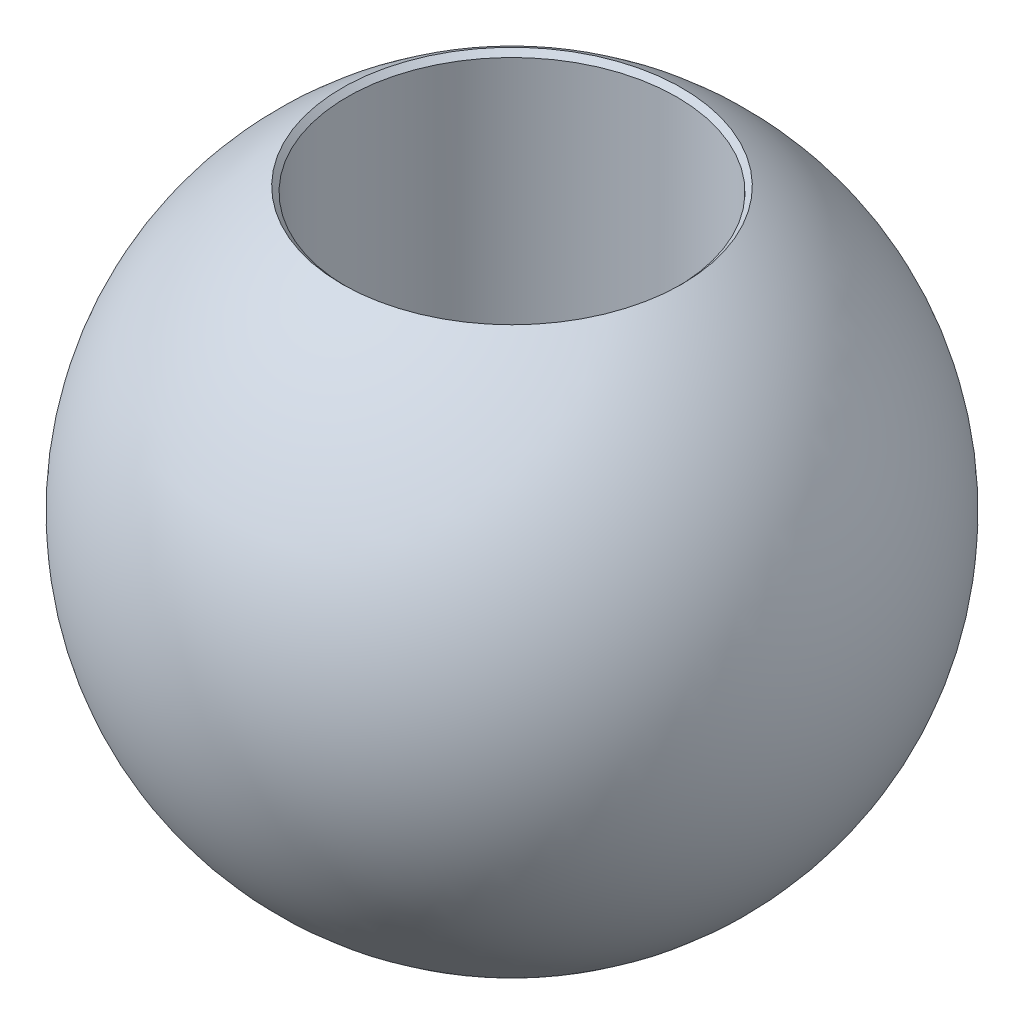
ISO-10303-21;
HEADER;
FILE_DESCRIPTION(('STEP AP214'),'2;1');
FILE_NAME('part.step','',(''),(''),'','','');
FILE_SCHEMA(('AUTOMOTIVE_DESIGN { 1 0 10303 214 1 1 1 1 }'));
ENDSEC;
DATA;
#1=APPLICATION_CONTEXT('core data for automotive mechanical design processes');
#2=APPLICATION_PROTOCOL_DEFINITION('international standard','automotive_design',2000,#1);
#3=PRODUCT_CONTEXT('',#1,'mechanical');
#4=PRODUCT('Part','Part','',(#3));
#5=PRODUCT_RELATED_PRODUCT_CATEGORY('part','',(#4));
#6=PRODUCT_DEFINITION_FORMATION('','',#4);
#7=PRODUCT_DEFINITION_CONTEXT('part definition',#1,'design');
#8=PRODUCT_DEFINITION('design','',#6,#7);
#9=PRODUCT_DEFINITION_SHAPE('','',#8);
#10=(LENGTH_UNIT() NAMED_UNIT(*) SI_UNIT(.MILLI.,.METRE.));
#11=(NAMED_UNIT(*) PLANE_ANGLE_UNIT() SI_UNIT($,.RADIAN.));
#12=(NAMED_UNIT(*) SI_UNIT($,.STERADIAN.) SOLID_ANGLE_UNIT());
#13=UNCERTAINTY_MEASURE_WITH_UNIT(LENGTH_MEASURE(1.E-05),#10,'distance_accuracy_value','');
#14=(GEOMETRIC_REPRESENTATION_CONTEXT(3) GLOBAL_UNCERTAINTY_ASSIGNED_CONTEXT((#13)) GLOBAL_UNIT_ASSIGNED_CONTEXT((#10,
#11,#12)) REPRESENTATION_CONTEXT('',''));
#15=CARTESIAN_POINT('',(0.,0.,0.));
#16=DIRECTION('',(0.,0.,1.));
#17=DIRECTION('',(1.,0.,0.));
#18=AXIS2_PLACEMENT_3D('',#15,#16,#17);
#19=CARTESIAN_POINT('',(0.,0.,0.));
#20=DIRECTION('',(0.,0.999999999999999,0.));
#21=DIRECTION('',(1.,0.,0.));
#22=AXIS2_PLACEMENT_3D('',#19,#20,#21);
#23=SPHERICAL_SURFACE('',#22,8.);
#24=CARTESIAN_POINT('',(0.,6.85402208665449,-2.22044604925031E-13));
#25=DIRECTION('',(0.,-0.999999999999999,0.));
#26=DIRECTION('',(0.,0.,-1.));
#27=AXIS2_PLACEMENT_3D('',#24,#25,#26);
#28=CIRCLE('',#27,4.12581885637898);
#29=CARTESIAN_POINT('',(4.12581885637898,6.85402208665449,0.));
#30=VERTEX_POINT('',#29);
#31=EDGE_CURVE('E41',#30,#30,#28,.T.);
#32=CARTESIAN_POINT('',(0.,-6.85402208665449,-2.77555756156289E-13));
#33=DIRECTION('',(0.,0.999999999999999,0.));
#34=DIRECTION('',(0.,0.,1.));
#35=AXIS2_PLACEMENT_3D('',#32,#33,#34);
#36=CIRCLE('',#35,4.12581885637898);
#37=CARTESIAN_POINT('',(4.12581885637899,-6.85402208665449,0.));
#38=VERTEX_POINT('',#37);
#39=EDGE_CURVE('E45',#38,#38,#36,.T.);
#40=CARTESIAN_POINT('',(4.12581885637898,6.85402208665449,0.));
#41=CARTESIAN_POINT('',(4.27274802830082,6.7655867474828,0.));
#42=CARTESIAN_POINT('',(4.41682433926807,6.67241385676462,0.));
#43=CARTESIAN_POINT('',(4.69869607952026,6.47700770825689,0.));
#44=CARTESIAN_POINT('',(4.83649150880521,6.37477445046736,0.));
#45=CARTESIAN_POINT('',(5.10522632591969,6.16166230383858,0.));
#46=CARTESIAN_POINT('',(5.23616571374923,6.05078341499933,0.));
#47=CARTESIAN_POINT('',(5.49064859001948,5.82084052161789,0.));
#48=CARTESIAN_POINT('',(5.61419207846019,5.70177651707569,0.));
#49=CARTESIAN_POINT('',(5.85337200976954,5.45595505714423,0.));
#50=CARTESIAN_POINT('',(5.96900845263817,5.32919760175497,0.));
#51=CARTESIAN_POINT('',(6.1918963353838,5.06851343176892,0.));
#52=CARTESIAN_POINT('',(6.2991477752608,4.93458671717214,0.));
#53=CARTESIAN_POINT('',(6.50482222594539,4.66011766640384,0.));
#54=CARTESIAN_POINT('',(6.60324523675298,4.51957533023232,0.));
#55=CARTESIAN_POINT('',(6.79085593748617,4.23245607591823,0.));
#56=CARTESIAN_POINT('',(6.88004362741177,4.08587915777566,0.));
#57=CARTESIAN_POINT('',(7.04881496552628,3.78729671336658,0.));
#58=CARTESIAN_POINT('',(7.12839861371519,3.63529118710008,0.));
#59=CARTESIAN_POINT('',(7.2776328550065,3.32647994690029,0.));
#60=CARTESIAN_POINT('',(7.3472834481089,3.16967423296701,0.));
#61=CARTESIAN_POINT('',(7.47636363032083,2.85191088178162,0.));
#62=CARTESIAN_POINT('',(7.53579321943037,2.69095324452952,0.));
#63=CARTESIAN_POINT('',(7.64418570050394,2.36555147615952,0.));
#64=CARTESIAN_POINT('',(7.69314859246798,2.20110734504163,0.));
#65=CARTESIAN_POINT('',(7.78040525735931,1.86941243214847,0.));
#66=CARTESIAN_POINT('',(7.81869903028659,1.7021616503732,0.));
#67=CARTESIAN_POINT('',(7.88445914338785,1.36554488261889,0.));
#68=CARTESIAN_POINT('',(7.91192548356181,1.19617889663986,0.));
#69=CARTESIAN_POINT('',(7.95591718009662,0.856031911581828,0.));
#70=CARTESIAN_POINT('',(7.97244253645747,0.685250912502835,0.));
#71=CARTESIAN_POINT('',(7.99448394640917,0.342979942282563,0.));
#72=CARTESIAN_POINT('',(8.00000000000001,0.171489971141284,0.));
#73=CARTESIAN_POINT('',(8.00000000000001,-0.171489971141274,0.));
#74=CARTESIAN_POINT('',(7.99448394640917,-0.342979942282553,0.));
#75=CARTESIAN_POINT('',(7.97244253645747,-0.685250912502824,0.));
#76=CARTESIAN_POINT('',(7.95591718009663,-0.856031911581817,0.));
#77=CARTESIAN_POINT('',(7.91192548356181,-1.19617889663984,0.));
#78=CARTESIAN_POINT('',(7.88445914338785,-1.36554488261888,0.));
#79=CARTESIAN_POINT('',(7.81869903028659,-1.70216165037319,0.));
#80=CARTESIAN_POINT('',(7.78040525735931,-1.86941243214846,0.));
#81=CARTESIAN_POINT('',(7.69314859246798,-2.20110734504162,0.));
#82=CARTESIAN_POINT('',(7.64418570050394,-2.36555147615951,0.));
#83=CARTESIAN_POINT('',(7.53579321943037,-2.69095324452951,0.));
#84=CARTESIAN_POINT('',(7.47636363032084,-2.85191088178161,0.));
#85=CARTESIAN_POINT('',(7.3472834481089,-3.169674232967,0.));
#86=CARTESIAN_POINT('',(7.2776328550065,-3.32647994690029,0.));
#87=CARTESIAN_POINT('',(7.12839861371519,-3.63529118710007,0.));
#88=CARTESIAN_POINT('',(7.04881496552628,-3.78729671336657,0.));
#89=CARTESIAN_POINT('',(6.88004362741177,-4.08587915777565,0.));
#90=CARTESIAN_POINT('',(6.79085593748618,-4.23245607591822,0.));
#91=CARTESIAN_POINT('',(6.60324523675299,-4.51957533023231,0.));
#92=CARTESIAN_POINT('',(6.5048222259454,-4.66011766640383,0.));
#93=CARTESIAN_POINT('',(6.29914777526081,-4.93458671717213,0.));
#94=CARTESIAN_POINT('',(6.19189633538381,-5.06851343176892,0.));
#95=CARTESIAN_POINT('',(5.96900845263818,-5.32919760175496,0.));
#96=CARTESIAN_POINT('',(5.85337200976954,-5.45595505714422,0.));
#97=CARTESIAN_POINT('',(5.6141920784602,-5.70177651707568,0.));
#98=CARTESIAN_POINT('',(5.49064859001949,-5.82084052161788,0.));
#99=CARTESIAN_POINT('',(5.23616571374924,-6.05078341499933,0.));
#100=CARTESIAN_POINT('',(5.1052263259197,-6.16166230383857,0.));
#101=CARTESIAN_POINT('',(4.83649150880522,-6.37477445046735,0.));
#102=CARTESIAN_POINT('',(4.69869607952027,-6.47700770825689,0.));
#103=CARTESIAN_POINT('',(4.41682433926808,-6.67241385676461,0.));
#104=CARTESIAN_POINT('',(4.27274802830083,-6.7655867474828,0.));
#105=CARTESIAN_POINT('',(4.12581885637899,-6.85402208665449,0.));
#106=B_SPLINE_CURVE_WITH_KNOTS('',3,(#40,#41,#42,#43,#44,#45,#46,#47,#48,#49,#50,#51,#52,#53,
#54,#55,#56,#57,#58,#59,#60,#61,#62,#63,#64,#65,#66,#67,#68,#69,#70,#71,#72,#73,#74,#75,#76,#77,
#78,#79,#80,#81,#82,#83,#84,#85,#86,#87,#88,#89,#90,#91,#92,#93,#94,#95,#96,#97,#98,#99,#100,
#101,#102,#103,#104,#105),.UNSPECIFIED.,.F.,.F.,(4,2,2,2,2,2,2,2,2,2,2,2,2,2,2,2,2,2,2,2,2,2,2,
2,2,2,2,2,2,2,2,2,4),(0.,0.514381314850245,1.02876262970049,1.54314394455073,2.05752525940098,
2.57190657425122,3.08628788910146,3.60066920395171,4.11505051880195,4.6294318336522,
5.14381314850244,5.65819446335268,6.17257577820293,6.68695709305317,7.20133840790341,
7.71571972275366,8.2301010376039,8.74448235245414,9.25886366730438,9.77324498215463,
10.2876262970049,10.8020076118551,11.3163889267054,11.8307702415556,12.3451515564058,
12.8595328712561,13.3739141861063,13.8882955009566,14.4026768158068,14.9170581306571,
15.4314394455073,15.9458207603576,16.4602020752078),.UNSPECIFIED.);
#107=EDGE_CURVE('BSEAM31',#30,#38,#106,.T.);
#108=ORIENTED_EDGE('',*,*,#31,.T.);
#109=ORIENTED_EDGE('',*,*,#39,.T.);
#110=ORIENTED_EDGE('',*,*,#107,.T.);
#111=ORIENTED_EDGE('',*,*,#107,.F.);
#112=EDGE_LOOP('',(#108,#110,#109,#111));
#113=FACE_BOUND('',#112,.T.);
#114=ADVANCED_FACE('F31',(#113),#23,.T.);
#115=CARTESIAN_POINT('',(0.,-8.,-1.11022302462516E-13));
#116=DIRECTION('',(0.,0.999999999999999,0.));
#117=DIRECTION('',(0.,0.,1.));
#118=AXIS2_PLACEMENT_3D('',#115,#116,#117);
#119=CYLINDRICAL_SURFACE('',#118,4.);
#120=CARTESIAN_POINT('',(0.,6.72820323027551,0.));
#121=DIRECTION('',(0.,-0.999999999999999,0.));
#122=DIRECTION('',(0.,0.,-1.));
#123=AXIS2_PLACEMENT_3D('',#120,#121,#122);
#124=CIRCLE('',#123,4.);
#125=CARTESIAN_POINT('',(0.,6.72820323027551,3.99999999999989));
#126=VERTEX_POINT('',#125);
#127=EDGE_CURVE('E10',#126,#126,#124,.F.);
#128=CARTESIAN_POINT('',(-1.66533453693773E-13,-6.72820323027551,-2.77555756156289E-13));
#129=DIRECTION('',(0.,0.999999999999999,0.));
#130=DIRECTION('',(0.,0.,1.));
#131=AXIS2_PLACEMENT_3D('',#128,#129,#130);
#132=CIRCLE('',#131,4.);
#133=CARTESIAN_POINT('',(0.,-6.72820323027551,3.99999999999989));
#134=VERTEX_POINT('',#133);
#135=EDGE_CURVE('E37',#134,#134,#132,.F.);
#136=CARTESIAN_POINT('',(0.,6.72820323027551,3.99999999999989));
#137=CARTESIAN_POINT('',(0.,6.58803232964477,3.99999999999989));
#138=CARTESIAN_POINT('',(0.,6.44786142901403,3.99999999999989));
#139=CARTESIAN_POINT('',(0.,6.16751962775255,3.99999999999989));
#140=CARTESIAN_POINT('',(0.,6.02734872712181,3.99999999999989));
#141=CARTESIAN_POINT('',(0.,5.74700692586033,3.99999999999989));
#142=CARTESIAN_POINT('',(0.,5.60683602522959,3.99999999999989));
#143=CARTESIAN_POINT('',(0.,5.32649422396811,3.99999999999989));
#144=CARTESIAN_POINT('',(0.,5.18632332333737,3.99999999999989));
#145=CARTESIAN_POINT('',(0.,4.90598152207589,3.99999999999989));
#146=CARTESIAN_POINT('',(0.,4.76581062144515,3.99999999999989));
#147=CARTESIAN_POINT('',(0.,4.48546882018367,3.99999999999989));
#148=CARTESIAN_POINT('',(0.,4.34529791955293,3.99999999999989));
#149=CARTESIAN_POINT('',(0.,4.06495611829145,3.99999999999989));
#150=CARTESIAN_POINT('',(0.,3.92478521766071,3.99999999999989));
#151=CARTESIAN_POINT('',(0.,3.64444341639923,3.99999999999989));
#152=CARTESIAN_POINT('',(0.,3.50427251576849,3.99999999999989));
#153=CARTESIAN_POINT('',(0.,3.22393071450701,3.99999999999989));
#154=CARTESIAN_POINT('',(0.,3.08375981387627,3.99999999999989));
#155=CARTESIAN_POINT('',(0.,2.8034180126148,3.99999999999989));
#156=CARTESIAN_POINT('',(0.,2.66324711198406,3.99999999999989));
#157=CARTESIAN_POINT('',(0.,2.38290531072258,3.99999999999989));
#158=CARTESIAN_POINT('',(0.,2.24273441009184,3.99999999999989));
#159=CARTESIAN_POINT('',(0.,1.96239260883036,3.99999999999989));
#160=CARTESIAN_POINT('',(0.,1.82222170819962,3.99999999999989));
#161=CARTESIAN_POINT('',(0.,1.54187990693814,3.99999999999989));
#162=CARTESIAN_POINT('',(0.,1.4017090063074,3.99999999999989));
#163=CARTESIAN_POINT('',(0.,1.12136720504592,3.99999999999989));
#164=CARTESIAN_POINT('',(0.,0.981196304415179,3.99999999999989));
#165=CARTESIAN_POINT('',(0.,0.7008545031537,3.99999999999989));
#166=CARTESIAN_POINT('',(0.,0.56068360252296,3.99999999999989));
#167=CARTESIAN_POINT('',(0.,0.28034180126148,3.99999999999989));
#168=CARTESIAN_POINT('',(0.,0.14017090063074,3.99999999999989));
#169=CARTESIAN_POINT('',(0.,-0.140170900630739,3.99999999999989));
#170=CARTESIAN_POINT('',(0.,-0.280341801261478,3.99999999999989));
#171=CARTESIAN_POINT('',(0.,-0.560683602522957,3.99999999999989));
#172=CARTESIAN_POINT('',(0.,-0.700854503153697,3.99999999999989));
#173=CARTESIAN_POINT('',(0.,-0.981196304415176,3.99999999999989));
#174=CARTESIAN_POINT('',(0.,-1.12136720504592,3.99999999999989));
#175=CARTESIAN_POINT('',(0.,-1.4017090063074,3.99999999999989));
#176=CARTESIAN_POINT('',(0.,-1.54187990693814,3.99999999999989));
#177=CARTESIAN_POINT('',(0.,-1.82222170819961,3.99999999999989));
#178=CARTESIAN_POINT('',(0.,-1.96239260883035,3.99999999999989));
#179=CARTESIAN_POINT('',(0.,-2.24273441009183,3.99999999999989));
#180=CARTESIAN_POINT('',(0.,-2.38290531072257,3.99999999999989));
#181=CARTESIAN_POINT('',(0.,-2.66324711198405,3.99999999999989));
#182=CARTESIAN_POINT('',(0.,-2.80341801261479,3.99999999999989));
#183=CARTESIAN_POINT('',(0.,-3.08375981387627,3.99999999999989));
#184=CARTESIAN_POINT('',(0.,-3.22393071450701,3.99999999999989));
#185=CARTESIAN_POINT('',(0.,-3.50427251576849,3.99999999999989));
#186=CARTESIAN_POINT('',(0.,-3.64444341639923,3.99999999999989));
#187=CARTESIAN_POINT('',(0.,-3.92478521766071,3.99999999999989));
#188=CARTESIAN_POINT('',(0.,-4.06495611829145,3.99999999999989));
#189=CARTESIAN_POINT('',(0.,-4.34529791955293,3.99999999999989));
#190=CARTESIAN_POINT('',(0.,-4.48546882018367,3.99999999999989));
#191=CARTESIAN_POINT('',(0.,-4.76581062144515,3.99999999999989));
#192=CARTESIAN_POINT('',(0.,-4.90598152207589,3.99999999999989));
#193=CARTESIAN_POINT('',(0.,-5.18632332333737,3.99999999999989));
#194=CARTESIAN_POINT('',(0.,-5.32649422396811,3.99999999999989));
#195=CARTESIAN_POINT('',(0.,-5.60683602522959,3.99999999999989));
#196=CARTESIAN_POINT('',(0.,-5.74700692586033,3.99999999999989));
#197=CARTESIAN_POINT('',(0.,-6.02734872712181,3.99999999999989));
#198=CARTESIAN_POINT('',(0.,-6.16751962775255,3.99999999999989));
#199=CARTESIAN_POINT('',(0.,-6.44786142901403,3.99999999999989));
#200=CARTESIAN_POINT('',(0.,-6.58803232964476,3.99999999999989));
#201=CARTESIAN_POINT('',(0.,-6.72820323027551,3.99999999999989));
#202=B_SPLINE_CURVE_WITH_KNOTS('',3,(#136,#137,#138,#139,#140,#141,#142,#143,#144,#145,#146,
#147,#148,#149,#150,#151,#152,#153,#154,#155,#156,#157,#158,#159,#160,#161,#162,#163,#164,#165,
#166,#167,#168,#169,#170,#171,#172,#173,#174,#175,#176,#177,#178,#179,#180,#181,#182,#183,#184,
#185,#186,#187,#188,#189,#190,#191,#192,#193,#194,#195,#196,#197,#198,#199,#200,#201),
.UNSPECIFIED.,.F.,.F.,(4,2,2,2,2,2,2,2,2,2,2,2,2,2,2,2,2,2,2,2,2,2,2,2,2,2,2,2,2,2,2,2,4),(0.,
0.420512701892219,0.841025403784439,1.26153810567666,1.68205080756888,2.1025635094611,
2.52307621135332,2.94358891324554,3.36410161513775,3.78461431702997,4.20512701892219,
4.62563972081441,5.04615242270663,5.46666512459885,5.88717782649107,6.30769052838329,
6.72820323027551,7.14871593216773,7.56922863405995,7.98974133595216,8.41025403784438,
8.8307667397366,9.25127944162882,9.67179214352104,10.0923048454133,10.5128175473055,
10.9333302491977,11.3538429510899,11.7743556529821,12.1948683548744,12.6153810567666,
13.0358937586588,13.456406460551),.UNSPECIFIED.);
#203=EDGE_CURVE('BSEAM60',#126,#134,#202,.T.);
#204=ORIENTED_EDGE('',*,*,#127,.T.);
#205=ORIENTED_EDGE('',*,*,#135,.T.);
#206=ORIENTED_EDGE('',*,*,#203,.T.);
#207=ORIENTED_EDGE('',*,*,#203,.F.);
#208=EDGE_LOOP('',(#204,#206,#205,#207));
#209=FACE_BOUND('',#208,.T.);
#210=ADVANCED_FACE('F60',(#209),#119,.F.);
#211=CARTESIAN_POINT('',(0.,6.85402208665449,-2.22044604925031E-13));
#212=DIRECTION('',(0.,0.999999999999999,0.));
#213=DIRECTION('',(0.,0.,1.));
#214=AXIS2_PLACEMENT_3D('',#211,#212,#213);
#215=CONICAL_SURFACE('',#214,4.12581885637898,0.785398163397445);
#216=ORIENTED_EDGE('',*,*,#127,.F.);
#217=EDGE_LOOP('',(#216));
#218=FACE_BOUND('',#217,.T.);
#219=ORIENTED_EDGE('',*,*,#31,.F.);
#220=EDGE_LOOP('',(#219));
#221=FACE_BOUND('',#220,.T.);
#222=ADVANCED_FACE('F54',(#218,#221),#215,.F.);
#223=CARTESIAN_POINT('',(0.,-6.85402208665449,-2.77555756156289E-13));
#224=DIRECTION('',(0.,-0.999999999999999,0.));
#225=DIRECTION('',(0.,0.,-1.));
#226=AXIS2_PLACEMENT_3D('',#223,#224,#225);
#227=CONICAL_SURFACE('',#226,4.12581885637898,0.785398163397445);
#228=ORIENTED_EDGE('',*,*,#135,.F.);
#229=EDGE_LOOP('',(#228));
#230=FACE_BOUND('',#229,.T.);
#231=ORIENTED_EDGE('',*,*,#39,.F.);
#232=EDGE_LOOP('',(#231));
#233=FACE_BOUND('',#232,.T.);
#234=ADVANCED_FACE('F52',(#230,#233),#227,.F.);
#235=CLOSED_SHELL('',(#114,#210,#222,#234));
#236=MANIFOLD_SOLID_BREP('B2',#235);
#237=ADVANCED_BREP_SHAPE_REPRESENTATION('',(#18,#236),#14);
#238=SHAPE_DEFINITION_REPRESENTATION(#9,#237);
ENDSEC;
END-ISO-10303-21;
